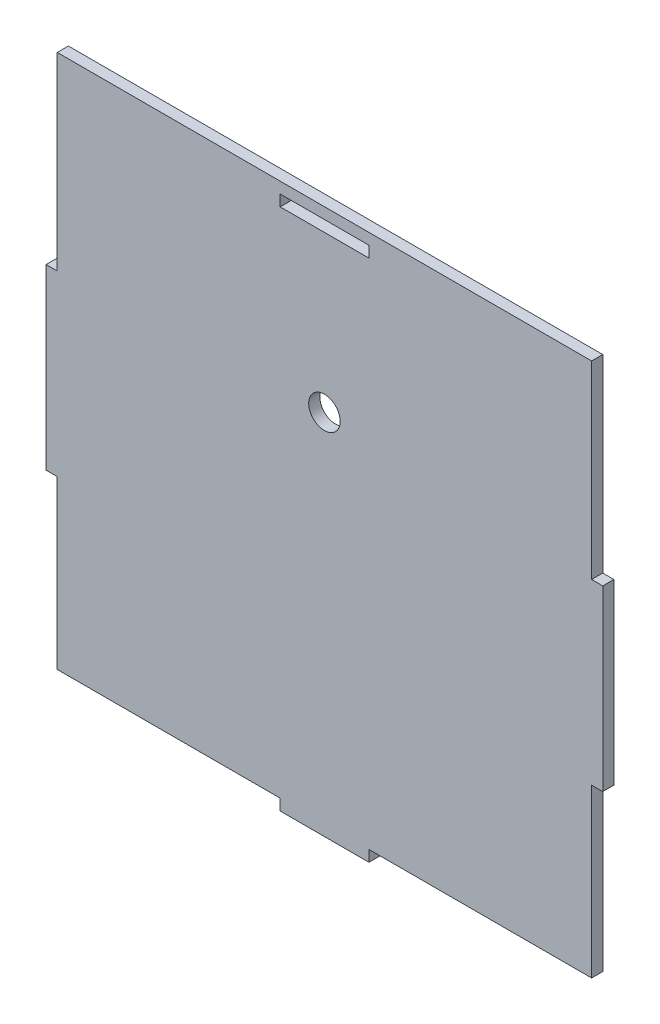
ISO-10303-21;
HEADER;
FILE_DESCRIPTION(('STEP AP214'),'2;1');
FILE_NAME('part.step','',(''),(''),'','','');
FILE_SCHEMA(('AUTOMOTIVE_DESIGN { 1 0 10303 214 1 1 1 1 }'));
ENDSEC;
DATA;
#1=APPLICATION_CONTEXT('core data for automotive mechanical design processes');
#2=APPLICATION_PROTOCOL_DEFINITION('international standard','automotive_design',2000,#1);
#3=PRODUCT_CONTEXT('',#1,'mechanical');
#4=PRODUCT('Part','Part','',(#3));
#5=PRODUCT_RELATED_PRODUCT_CATEGORY('part','',(#4));
#6=PRODUCT_DEFINITION_FORMATION('','',#4);
#7=PRODUCT_DEFINITION_CONTEXT('part definition',#1,'design');
#8=PRODUCT_DEFINITION('design','',#6,#7);
#9=PRODUCT_DEFINITION_SHAPE('','',#8);
#10=(LENGTH_UNIT() NAMED_UNIT(*) SI_UNIT(.MILLI.,.METRE.));
#11=(NAMED_UNIT(*) PLANE_ANGLE_UNIT() SI_UNIT($,.RADIAN.));
#12=(NAMED_UNIT(*) SI_UNIT($,.STERADIAN.) SOLID_ANGLE_UNIT());
#13=UNCERTAINTY_MEASURE_WITH_UNIT(LENGTH_MEASURE(1.E-05),#10,'distance_accuracy_value','');
#14=(GEOMETRIC_REPRESENTATION_CONTEXT(3) GLOBAL_UNCERTAINTY_ASSIGNED_CONTEXT((#13)) GLOBAL_UNIT_ASSIGNED_CONTEXT((#10,
#11,#12)) REPRESENTATION_CONTEXT('',''));
#15=CARTESIAN_POINT('',(0.,0.,0.));
#16=DIRECTION('',(0.,0.,1.));
#17=DIRECTION('',(1.,0.,0.));
#18=AXIS2_PLACEMENT_3D('',#15,#16,#17);
#19=CARTESIAN_POINT('',(-30.4580633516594,-24.0194605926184,3.175));
#20=DIRECTION('',(0.,0.,-1.));
#21=DIRECTION('',(-1.,0.,0.));
#22=AXIS2_PLACEMENT_3D('',#19,#20,#21);
#23=PLANE('',#22);
#24=DIRECTION('',(0.,-1.,0.));
#25=VECTOR('',#24,1.);
#26=CARTESIAN_POINT('',(33.1213613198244,26.7805394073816,3.175));
#27=LINE('',#26,#25);
#28=CARTESIAN_POINT('',(33.1213613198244,26.7805394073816,3.175));
#29=VERTEX_POINT('',#28);
#30=CARTESIAN_POINT('',(33.1213613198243,23.6055394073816,3.175));
#31=VERTEX_POINT('',#30);
#32=EDGE_CURVE('E169',#29,#31,#27,.T.);
#33=ORIENTED_EDGE('',*,*,#32,.F.);
#34=DIRECTION('',(-1.,0.,0.));
#35=VECTOR('',#34,1.);
#36=CARTESIAN_POINT('',(33.1213613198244,26.7805394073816,3.175));
#37=LINE('',#36,#35);
#38=CARTESIAN_POINT('',(58.5213613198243,26.7805394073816,3.175));
#39=VERTEX_POINT('',#38);
#40=EDGE_CURVE('E192',#39,#29,#37,.T.);
#41=ORIENTED_EDGE('',*,*,#40,.F.);
#42=DIRECTION('',(0.,1.,0.));
#43=VECTOR('',#42,1.);
#44=CARTESIAN_POINT('',(58.5213613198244,26.7805394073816,3.175));
#45=LINE('',#44,#43);
#46=CARTESIAN_POINT('',(58.5213613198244,23.6055394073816,3.175));
#47=VERTEX_POINT('',#46);
#48=EDGE_CURVE('E190',#47,#39,#45,.T.);
#49=ORIENTED_EDGE('',*,*,#48,.F.);
#50=DIRECTION('',(1.,0.,0.));
#51=VECTOR('',#50,1.);
#52=CARTESIAN_POINT('',(33.1213613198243,23.6055394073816,3.175));
#53=LINE('',#52,#51);
#54=EDGE_CURVE('E177',#31,#47,#53,.T.);
#55=ORIENTED_EDGE('',*,*,#54,.F.);
#56=EDGE_LOOP('',(#33,#41,#49,#55));
#57=FACE_BOUND('',#56,.T.);
#58=DIRECTION('',(0.,-1.,0.));
#59=VECTOR('',#58,1.);
#60=CARTESIAN_POINT('',(-30.4580633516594,29.9555394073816,3.175));
#61=LINE('',#60,#59);
#62=CARTESIAN_POINT('',(-30.4580633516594,29.9555394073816,3.175));
#63=VERTEX_POINT('',#62);
#64=CARTESIAN_POINT('',(-30.4580633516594,-24.0194605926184,3.175));
#65=VERTEX_POINT('',#64);
#66=EDGE_CURVE('E208',#63,#65,#61,.T.);
#67=ORIENTED_EDGE('',*,*,#66,.T.);
#68=DIRECTION('',(-1.,0.,0.));
#69=VECTOR('',#68,1.);
#70=CARTESIAN_POINT('',(-30.4580633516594,-24.0194605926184,3.175));
#71=LINE('',#70,#69);
#72=CARTESIAN_POINT('',(-33.6330633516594,-24.0194605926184,3.175));
#73=VERTEX_POINT('',#72);
#74=EDGE_CURVE('E211',#65,#73,#71,.T.);
#75=ORIENTED_EDGE('',*,*,#74,.T.);
#76=DIRECTION('',(0.,-1.,0.));
#77=VECTOR('',#76,1.);
#78=CARTESIAN_POINT('',(-33.6330633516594,-24.0194605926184,3.175));
#79=LINE('',#78,#77);
#80=CARTESIAN_POINT('',(-33.6330633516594,-74.8194605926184,3.175));
#81=VERTEX_POINT('',#80);
#82=EDGE_CURVE('E214',#73,#81,#79,.T.);
#83=ORIENTED_EDGE('',*,*,#82,.T.);
#84=DIRECTION('',(1.,0.,0.));
#85=VECTOR('',#84,1.);
#86=CARTESIAN_POINT('',(-30.4580633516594,-74.8194605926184,3.175));
#87=LINE('',#86,#85);
#88=CARTESIAN_POINT('',(-30.4580633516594,-74.8194605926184,3.175));
#89=VERTEX_POINT('',#88);
#90=EDGE_CURVE('E216',#81,#89,#87,.T.);
#91=ORIENTED_EDGE('',*,*,#90,.T.);
#92=DIRECTION('',(0.,-1.,0.));
#93=VECTOR('',#92,1.);
#94=CARTESIAN_POINT('',(-30.4580633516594,-74.8194605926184,3.175));
#95=LINE('',#94,#93);
#96=CARTESIAN_POINT('',(-30.4580633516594,-122.444460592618,3.175));
#97=VERTEX_POINT('',#96);
#98=EDGE_CURVE('E218',#89,#97,#95,.T.);
#99=ORIENTED_EDGE('',*,*,#98,.T.);
#100=DIRECTION('',(1.,0.,0.));
#101=VECTOR('',#100,1.);
#102=CARTESIAN_POINT('',(-30.4580633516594,-122.444460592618,3.175));
#103=LINE('',#102,#101);
#104=CARTESIAN_POINT('',(33.0419366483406,-122.444460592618,3.175));
#105=VERTEX_POINT('',#104);
#106=EDGE_CURVE('E220',#97,#105,#103,.T.);
#107=ORIENTED_EDGE('',*,*,#106,.T.);
#108=DIRECTION('',(0.,-1.,0.));
#109=VECTOR('',#108,1.);
#110=CARTESIAN_POINT('',(33.0419366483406,-122.444460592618,3.175));
#111=LINE('',#110,#109);
#112=CARTESIAN_POINT('',(33.0419366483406,-125.619460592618,3.175));
#113=VERTEX_POINT('',#112);
#114=EDGE_CURVE('E222',#105,#113,#111,.T.);
#115=ORIENTED_EDGE('',*,*,#114,.T.);
#116=DIRECTION('',(1.,0.,0.));
#117=VECTOR('',#116,1.);
#118=CARTESIAN_POINT('',(33.0419366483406,-125.619460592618,3.175));
#119=LINE('',#118,#117);
#120=CARTESIAN_POINT('',(58.4419366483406,-125.619460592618,3.175));
#121=VERTEX_POINT('',#120);
#122=EDGE_CURVE('E224',#113,#121,#119,.T.);
#123=ORIENTED_EDGE('',*,*,#122,.T.);
#124=DIRECTION('',(0.,1.,0.));
#125=VECTOR('',#124,1.);
#126=CARTESIAN_POINT('',(58.4419366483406,-122.444460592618,3.175));
#127=LINE('',#126,#125);
#128=CARTESIAN_POINT('',(58.4419366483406,-122.444460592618,3.175));
#129=VERTEX_POINT('',#128);
#130=EDGE_CURVE('E226',#121,#129,#127,.T.);
#131=ORIENTED_EDGE('',*,*,#130,.T.);
#132=DIRECTION('',(1.,0.,0.));
#133=VECTOR('',#132,1.);
#134=CARTESIAN_POINT('',(58.4419366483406,-122.444460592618,3.175));
#135=LINE('',#134,#133);
#136=CARTESIAN_POINT('',(121.941936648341,-122.444460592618,3.175));
#137=VERTEX_POINT('',#136);
#138=EDGE_CURVE('E228',#129,#137,#135,.T.);
#139=ORIENTED_EDGE('',*,*,#138,.T.);
#140=DIRECTION('',(0.,1.,0.));
#141=VECTOR('',#140,1.);
#142=CARTESIAN_POINT('',(121.941936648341,-74.8194605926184,3.175));
#143=LINE('',#142,#141);
#144=CARTESIAN_POINT('',(121.941936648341,-74.8194605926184,3.175));
#145=VERTEX_POINT('',#144);
#146=EDGE_CURVE('E230',#137,#145,#143,.T.);
#147=ORIENTED_EDGE('',*,*,#146,.T.);
#148=DIRECTION('',(1.,0.,0.));
#149=VECTOR('',#148,1.);
#150=CARTESIAN_POINT('',(121.941936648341,-74.8194605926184,3.175));
#151=LINE('',#150,#149);
#152=CARTESIAN_POINT('',(125.116936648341,-74.8194605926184,3.175));
#153=VERTEX_POINT('',#152);
#154=EDGE_CURVE('E232',#145,#153,#151,.T.);
#155=ORIENTED_EDGE('',*,*,#154,.T.);
#156=DIRECTION('',(0.,1.,0.));
#157=VECTOR('',#156,1.);
#158=CARTESIAN_POINT('',(125.116936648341,-24.0194605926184,3.175));
#159=LINE('',#158,#157);
#160=CARTESIAN_POINT('',(125.116936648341,-24.0194605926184,3.175));
#161=VERTEX_POINT('',#160);
#162=EDGE_CURVE('E234',#153,#161,#159,.T.);
#163=ORIENTED_EDGE('',*,*,#162,.T.);
#164=DIRECTION('',(-1.,0.,0.));
#165=VECTOR('',#164,1.);
#166=CARTESIAN_POINT('',(121.941936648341,-24.0194605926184,3.175));
#167=LINE('',#166,#165);
#168=CARTESIAN_POINT('',(121.941936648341,-24.0194605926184,3.175));
#169=VERTEX_POINT('',#168);
#170=EDGE_CURVE('E236',#161,#169,#167,.T.);
#171=ORIENTED_EDGE('',*,*,#170,.T.);
#172=DIRECTION('',(0.,1.,0.));
#173=VECTOR('',#172,1.);
#174=CARTESIAN_POINT('',(121.941936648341,29.9555394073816,3.175));
#175=LINE('',#174,#173);
#176=CARTESIAN_POINT('',(121.941936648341,29.9555394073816,3.175));
#177=VERTEX_POINT('',#176);
#178=EDGE_CURVE('E238',#169,#177,#175,.T.);
#179=ORIENTED_EDGE('',*,*,#178,.T.);
#180=DIRECTION('',(-1.,0.,0.));
#181=VECTOR('',#180,1.);
#182=CARTESIAN_POINT('',(-30.4580633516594,29.9555394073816,3.175));
#183=LINE('',#182,#181);
#184=EDGE_CURVE('E240',#177,#63,#183,.T.);
#185=ORIENTED_EDGE('',*,*,#184,.T.);
#186=EDGE_LOOP('',(#67,#75,#83,#91,#99,#107,#115,#123,#131,#139,#147,#155,#163,#171,#179,#185));
#187=FACE_BOUND('',#186,.T.);
#188=CARTESIAN_POINT('',(45.7419366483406,-20.8444605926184,3.175));
#189=DIRECTION('',(0.,0.,1.));
#190=DIRECTION('',(1.,0.,0.));
#191=AXIS2_PLACEMENT_3D('',#188,#189,#190);
#192=CIRCLE('',#191,4.49012806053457);
#193=CARTESIAN_POINT('',(50.2320647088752,-20.8444605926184,3.175));
#194=VERTEX_POINT('',#193);
#195=EDGE_CURVE('E198',#194,#194,#192,.T.);
#196=ORIENTED_EDGE('',*,*,#195,.F.);
#197=EDGE_LOOP('',(#196));
#198=FACE_BOUND('',#197,.T.);
#199=ADVANCED_FACE('F32',(#57,#187,#198),#23,.F.);
#200=CARTESIAN_POINT('',(-30.4580633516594,-24.0194605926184,0.));
#201=DIRECTION('',(0.,0.,-1.));
#202=DIRECTION('',(-1.,0.,0.));
#203=AXIS2_PLACEMENT_3D('',#200,#201,#202);
#204=PLANE('',#203);
#205=DIRECTION('',(-1.,0.,0.));
#206=VECTOR('',#205,1.);
#207=CARTESIAN_POINT('',(33.1213613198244,26.7805394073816,0.));
#208=LINE('',#207,#206);
#209=CARTESIAN_POINT('',(58.5213613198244,26.7805394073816,0.));
#210=VERTEX_POINT('',#209);
#211=CARTESIAN_POINT('',(33.1213613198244,26.7805394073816,0.));
#212=VERTEX_POINT('',#211);
#213=EDGE_CURVE('E178',#210,#212,#208,.T.);
#214=ORIENTED_EDGE('',*,*,#213,.T.);
#215=DIRECTION('',(0.,-1.,0.));
#216=VECTOR('',#215,1.);
#217=CARTESIAN_POINT('',(33.1213613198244,26.7805394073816,0.));
#218=LINE('',#217,#216);
#219=CARTESIAN_POINT('',(33.1213613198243,23.6055394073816,0.));
#220=VERTEX_POINT('',#219);
#221=EDGE_CURVE('E55',#212,#220,#218,.T.);
#222=ORIENTED_EDGE('',*,*,#221,.T.);
#223=DIRECTION('',(1.,0.,0.));
#224=VECTOR('',#223,1.);
#225=CARTESIAN_POINT('',(33.1213613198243,23.6055394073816,0.));
#226=LINE('',#225,#224);
#227=CARTESIAN_POINT('',(58.5213613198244,23.6055394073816,0.));
#228=VERTEX_POINT('',#227);
#229=EDGE_CURVE('E184',#220,#228,#226,.T.);
#230=ORIENTED_EDGE('',*,*,#229,.T.);
#231=DIRECTION('',(0.,1.,0.));
#232=VECTOR('',#231,1.);
#233=CARTESIAN_POINT('',(58.5213613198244,26.7805394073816,0.));
#234=LINE('',#233,#232);
#235=EDGE_CURVE('E200',#228,#210,#234,.T.);
#236=ORIENTED_EDGE('',*,*,#235,.T.);
#237=EDGE_LOOP('',(#214,#222,#230,#236));
#238=FACE_BOUND('',#237,.T.);
#239=DIRECTION('',(0.,-1.,0.));
#240=VECTOR('',#239,1.);
#241=CARTESIAN_POINT('',(-30.4580633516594,29.9555394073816,0.));
#242=LINE('',#241,#240);
#243=CARTESIAN_POINT('',(-30.4580633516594,29.9555394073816,0.));
#244=VERTEX_POINT('',#243);
#245=CARTESIAN_POINT('',(-30.4580633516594,-24.0194605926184,0.));
#246=VERTEX_POINT('',#245);
#247=EDGE_CURVE('E185',#244,#246,#242,.T.);
#248=ORIENTED_EDGE('',*,*,#247,.F.);
#249=DIRECTION('',(-1.,0.,0.));
#250=VECTOR('',#249,1.);
#251=CARTESIAN_POINT('',(-30.4580633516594,29.9555394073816,0.));
#252=LINE('',#251,#250);
#253=CARTESIAN_POINT('',(121.941936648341,29.9555394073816,0.));
#254=VERTEX_POINT('',#253);
#255=EDGE_CURVE('E212',#254,#244,#252,.T.);
#256=ORIENTED_EDGE('',*,*,#255,.F.);
#257=DIRECTION('',(0.,1.,0.));
#258=VECTOR('',#257,1.);
#259=CARTESIAN_POINT('',(121.941936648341,29.9555394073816,0.));
#260=LINE('',#259,#258);
#261=CARTESIAN_POINT('',(121.941936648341,-24.0194605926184,0.));
#262=VERTEX_POINT('',#261);
#263=EDGE_CURVE('E271',#262,#254,#260,.T.);
#264=ORIENTED_EDGE('',*,*,#263,.F.);
#265=DIRECTION('',(-1.,0.,0.));
#266=VECTOR('',#265,1.);
#267=CARTESIAN_POINT('',(121.941936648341,-24.0194605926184,0.));
#268=LINE('',#267,#266);
#269=CARTESIAN_POINT('',(125.116936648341,-24.0194605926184,0.));
#270=VERTEX_POINT('',#269);
#271=EDGE_CURVE('E269',#270,#262,#268,.T.);
#272=ORIENTED_EDGE('',*,*,#271,.F.);
#273=DIRECTION('',(0.,1.,0.));
#274=VECTOR('',#273,1.);
#275=CARTESIAN_POINT('',(125.116936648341,-24.0194605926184,0.));
#276=LINE('',#275,#274);
#277=CARTESIAN_POINT('',(125.116936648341,-74.8194605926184,0.));
#278=VERTEX_POINT('',#277);
#279=EDGE_CURVE('E267',#278,#270,#276,.T.);
#280=ORIENTED_EDGE('',*,*,#279,.F.);
#281=DIRECTION('',(1.,0.,0.));
#282=VECTOR('',#281,1.);
#283=CARTESIAN_POINT('',(121.941936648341,-74.8194605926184,0.));
#284=LINE('',#283,#282);
#285=CARTESIAN_POINT('',(121.941936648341,-74.8194605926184,0.));
#286=VERTEX_POINT('',#285);
#287=EDGE_CURVE('E265',#286,#278,#284,.T.);
#288=ORIENTED_EDGE('',*,*,#287,.F.);
#289=DIRECTION('',(0.,1.,0.));
#290=VECTOR('',#289,1.);
#291=CARTESIAN_POINT('',(121.941936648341,-74.8194605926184,0.));
#292=LINE('',#291,#290);
#293=CARTESIAN_POINT('',(121.941936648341,-122.444460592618,0.));
#294=VERTEX_POINT('',#293);
#295=EDGE_CURVE('E263',#294,#286,#292,.T.);
#296=ORIENTED_EDGE('',*,*,#295,.F.);
#297=DIRECTION('',(1.,0.,0.));
#298=VECTOR('',#297,1.);
#299=CARTESIAN_POINT('',(58.4419366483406,-122.444460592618,0.));
#300=LINE('',#299,#298);
#301=CARTESIAN_POINT('',(58.4419366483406,-122.444460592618,0.));
#302=VERTEX_POINT('',#301);
#303=EDGE_CURVE('E261',#302,#294,#300,.T.);
#304=ORIENTED_EDGE('',*,*,#303,.F.);
#305=DIRECTION('',(0.,1.,0.));
#306=VECTOR('',#305,1.);
#307=CARTESIAN_POINT('',(58.4419366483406,-122.444460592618,0.));
#308=LINE('',#307,#306);
#309=CARTESIAN_POINT('',(58.4419366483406,-125.619460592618,0.));
#310=VERTEX_POINT('',#309);
#311=EDGE_CURVE('E259',#310,#302,#308,.T.);
#312=ORIENTED_EDGE('',*,*,#311,.F.);
#313=DIRECTION('',(1.,0.,0.));
#314=VECTOR('',#313,1.);
#315=CARTESIAN_POINT('',(33.0419366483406,-125.619460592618,0.));
#316=LINE('',#315,#314);
#317=CARTESIAN_POINT('',(33.0419366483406,-125.619460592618,0.));
#318=VERTEX_POINT('',#317);
#319=EDGE_CURVE('E257',#318,#310,#316,.T.);
#320=ORIENTED_EDGE('',*,*,#319,.F.);
#321=DIRECTION('',(0.,-1.,0.));
#322=VECTOR('',#321,1.);
#323=CARTESIAN_POINT('',(33.0419366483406,-122.444460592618,0.));
#324=LINE('',#323,#322);
#325=CARTESIAN_POINT('',(33.0419366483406,-122.444460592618,0.));
#326=VERTEX_POINT('',#325);
#327=EDGE_CURVE('E255',#326,#318,#324,.T.);
#328=ORIENTED_EDGE('',*,*,#327,.F.);
#329=DIRECTION('',(1.,0.,0.));
#330=VECTOR('',#329,1.);
#331=CARTESIAN_POINT('',(-30.4580633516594,-122.444460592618,0.));
#332=LINE('',#331,#330);
#333=CARTESIAN_POINT('',(-30.4580633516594,-122.444460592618,0.));
#334=VERTEX_POINT('',#333);
#335=EDGE_CURVE('E253',#334,#326,#332,.T.);
#336=ORIENTED_EDGE('',*,*,#335,.F.);
#337=DIRECTION('',(0.,-1.,0.));
#338=VECTOR('',#337,1.);
#339=CARTESIAN_POINT('',(-30.4580633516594,-74.8194605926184,0.));
#340=LINE('',#339,#338);
#341=CARTESIAN_POINT('',(-30.4580633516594,-74.8194605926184,0.));
#342=VERTEX_POINT('',#341);
#343=EDGE_CURVE('E251',#342,#334,#340,.T.);
#344=ORIENTED_EDGE('',*,*,#343,.F.);
#345=DIRECTION('',(1.,0.,0.));
#346=VECTOR('',#345,1.);
#347=CARTESIAN_POINT('',(-30.4580633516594,-74.8194605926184,0.));
#348=LINE('',#347,#346);
#349=CARTESIAN_POINT('',(-33.6330633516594,-74.8194605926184,0.));
#350=VERTEX_POINT('',#349);
#351=EDGE_CURVE('E249',#350,#342,#348,.T.);
#352=ORIENTED_EDGE('',*,*,#351,.F.);
#353=DIRECTION('',(0.,-1.,0.));
#354=VECTOR('',#353,1.);
#355=CARTESIAN_POINT('',(-33.6330633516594,-24.0194605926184,0.));
#356=LINE('',#355,#354);
#357=CARTESIAN_POINT('',(-33.6330633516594,-24.0194605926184,0.));
#358=VERTEX_POINT('',#357);
#359=EDGE_CURVE('E247',#358,#350,#356,.T.);
#360=ORIENTED_EDGE('',*,*,#359,.F.);
#361=DIRECTION('',(-1.,0.,0.));
#362=VECTOR('',#361,1.);
#363=CARTESIAN_POINT('',(-30.4580633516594,-24.0194605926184,0.));
#364=LINE('',#363,#362);
#365=EDGE_CURVE('E245',#246,#358,#364,.T.);
#366=ORIENTED_EDGE('',*,*,#365,.F.);
#367=EDGE_LOOP('',(#248,#256,#264,#272,#280,#288,#296,#304,#312,#320,#328,#336,#344,#352,#360,#366));
#368=FACE_BOUND('',#367,.T.);
#369=CARTESIAN_POINT('',(45.7419366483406,-20.8444605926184,0.));
#370=DIRECTION('',(0.,0.,1.));
#371=DIRECTION('',(1.,0.,0.));
#372=AXIS2_PLACEMENT_3D('',#369,#370,#371);
#373=CIRCLE('',#372,4.49012806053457);
#374=CARTESIAN_POINT('',(50.2320647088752,-20.8444605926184,0.));
#375=VERTEX_POINT('',#374);
#376=EDGE_CURVE('E589',#375,#375,#373,.T.);
#377=ORIENTED_EDGE('',*,*,#376,.T.);
#378=EDGE_LOOP('',(#377));
#379=FACE_BOUND('',#378,.T.);
#380=ADVANCED_FACE('F325',(#238,#368,#379),#204,.T.);
#381=CARTESIAN_POINT('',(-30.4580633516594,29.9555394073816,3.175));
#382=DIRECTION('',(1.,0.,0.));
#383=DIRECTION('',(0.,1.,0.));
#384=AXIS2_PLACEMENT_3D('',#381,#382,#383);
#385=PLANE('',#384);
#386=ORIENTED_EDGE('',*,*,#247,.T.);
#387=DIRECTION('',(0.,0.,-1.));
#388=VECTOR('',#387,1.);
#389=CARTESIAN_POINT('',(-30.4580633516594,-24.0194605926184,3.175));
#390=LINE('',#389,#388);
#391=EDGE_CURVE('E11',#65,#246,#390,.T.);
#392=ORIENTED_EDGE('',*,*,#391,.F.);
#393=ORIENTED_EDGE('',*,*,#66,.F.);
#394=DIRECTION('',(0.,0.,-1.));
#395=VECTOR('',#394,1.);
#396=CARTESIAN_POINT('',(-30.4580633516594,29.9555394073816,3.175));
#397=LINE('',#396,#395);
#398=EDGE_CURVE('E242',#63,#244,#397,.T.);
#399=ORIENTED_EDGE('',*,*,#398,.T.);
#400=EDGE_LOOP('',(#386,#392,#393,#399));
#401=FACE_BOUND('',#400,.T.);
#402=ADVANCED_FACE('F34',(#401),#385,.F.);
#403=CARTESIAN_POINT('',(-30.4580633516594,-24.0194605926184,3.175));
#404=DIRECTION('',(0.,-1.,0.));
#405=DIRECTION('',(0.,0.,-1.));
#406=AXIS2_PLACEMENT_3D('',#403,#404,#405);
#407=PLANE('',#406);
#408=ORIENTED_EDGE('',*,*,#365,.T.);
#409=DIRECTION('',(0.,0.,-1.));
#410=VECTOR('',#409,1.);
#411=CARTESIAN_POINT('',(-33.6330633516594,-24.0194605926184,3.175));
#412=LINE('',#411,#410);
#413=EDGE_CURVE('E40',#73,#358,#412,.T.);
#414=ORIENTED_EDGE('',*,*,#413,.F.);
#415=ORIENTED_EDGE('',*,*,#74,.F.);
#416=ORIENTED_EDGE('',*,*,#391,.T.);
#417=EDGE_LOOP('',(#408,#414,#415,#416));
#418=FACE_BOUND('',#417,.T.);
#419=ADVANCED_FACE('F342',(#418),#407,.F.);
#420=CARTESIAN_POINT('',(-33.6330633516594,-24.0194605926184,3.175));
#421=DIRECTION('',(1.,0.,0.));
#422=DIRECTION('',(0.,1.,0.));
#423=AXIS2_PLACEMENT_3D('',#420,#421,#422);
#424=PLANE('',#423);
#425=ORIENTED_EDGE('',*,*,#359,.T.);
#426=DIRECTION('',(0.,0.,-1.));
#427=VECTOR('',#426,1.);
#428=CARTESIAN_POINT('',(-33.6330633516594,-74.8194605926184,3.175));
#429=LINE('',#428,#427);
#430=EDGE_CURVE('E312',#81,#350,#429,.T.);
#431=ORIENTED_EDGE('',*,*,#430,.F.);
#432=ORIENTED_EDGE('',*,*,#82,.F.);
#433=ORIENTED_EDGE('',*,*,#413,.T.);
#434=EDGE_LOOP('',(#425,#431,#432,#433));
#435=FACE_BOUND('',#434,.T.);
#436=ADVANCED_FACE('F319',(#435),#424,.F.);
#437=CARTESIAN_POINT('',(-30.4580633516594,-74.8194605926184,3.175));
#438=DIRECTION('',(0.,1.,0.));
#439=DIRECTION('',(0.,0.,1.));
#440=AXIS2_PLACEMENT_3D('',#437,#438,#439);
#441=PLANE('',#440);
#442=ORIENTED_EDGE('',*,*,#351,.T.);
#443=DIRECTION('',(0.,0.,-1.));
#444=VECTOR('',#443,1.);
#445=CARTESIAN_POINT('',(-30.4580633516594,-74.8194605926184,3.175));
#446=LINE('',#445,#444);
#447=EDGE_CURVE('E309',#89,#342,#446,.T.);
#448=ORIENTED_EDGE('',*,*,#447,.F.);
#449=ORIENTED_EDGE('',*,*,#90,.F.);
#450=ORIENTED_EDGE('',*,*,#430,.T.);
#451=EDGE_LOOP('',(#442,#448,#449,#450));
#452=FACE_BOUND('',#451,.T.);
#453=ADVANCED_FACE('F331',(#452),#441,.F.);
#454=CARTESIAN_POINT('',(-30.4580633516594,-74.8194605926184,3.175));
#455=DIRECTION('',(1.,0.,0.));
#456=DIRECTION('',(0.,1.,0.));
#457=AXIS2_PLACEMENT_3D('',#454,#455,#456);
#458=PLANE('',#457);
#459=ORIENTED_EDGE('',*,*,#343,.T.);
#460=DIRECTION('',(0.,0.,-1.));
#461=VECTOR('',#460,1.);
#462=CARTESIAN_POINT('',(-30.4580633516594,-122.444460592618,3.175));
#463=LINE('',#462,#461);
#464=EDGE_CURVE('E306',#97,#334,#463,.T.);
#465=ORIENTED_EDGE('',*,*,#464,.F.);
#466=ORIENTED_EDGE('',*,*,#98,.F.);
#467=ORIENTED_EDGE('',*,*,#447,.T.);
#468=EDGE_LOOP('',(#459,#465,#466,#467));
#469=FACE_BOUND('',#468,.T.);
#470=ADVANCED_FACE('F335',(#469),#458,.F.);
#471=CARTESIAN_POINT('',(-30.4580633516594,-122.444460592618,3.175));
#472=DIRECTION('',(0.,1.,0.));
#473=DIRECTION('',(0.,0.,1.));
#474=AXIS2_PLACEMENT_3D('',#471,#472,#473);
#475=PLANE('',#474);
#476=ORIENTED_EDGE('',*,*,#335,.T.);
#477=DIRECTION('',(0.,0.,-1.));
#478=VECTOR('',#477,1.);
#479=CARTESIAN_POINT('',(33.0419366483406,-122.444460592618,3.175));
#480=LINE('',#479,#478);
#481=EDGE_CURVE('E303',#105,#326,#480,.T.);
#482=ORIENTED_EDGE('',*,*,#481,.F.);
#483=ORIENTED_EDGE('',*,*,#106,.F.);
#484=ORIENTED_EDGE('',*,*,#464,.T.);
#485=EDGE_LOOP('',(#476,#482,#483,#484));
#486=FACE_BOUND('',#485,.T.);
#487=ADVANCED_FACE('F395',(#486),#475,.F.);
#488=CARTESIAN_POINT('',(33.0419366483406,-122.444460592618,3.175));
#489=DIRECTION('',(1.,0.,0.));
#490=DIRECTION('',(0.,0.,-1.));
#491=AXIS2_PLACEMENT_3D('',#488,#489,#490);
#492=PLANE('',#491);
#493=ORIENTED_EDGE('',*,*,#327,.T.);
#494=DIRECTION('',(0.,0.,-1.));
#495=VECTOR('',#494,1.);
#496=CARTESIAN_POINT('',(33.0419366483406,-125.619460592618,3.175));
#497=LINE('',#496,#495);
#498=EDGE_CURVE('E300',#113,#318,#497,.T.);
#499=ORIENTED_EDGE('',*,*,#498,.F.);
#500=ORIENTED_EDGE('',*,*,#114,.F.);
#501=ORIENTED_EDGE('',*,*,#481,.T.);
#502=EDGE_LOOP('',(#493,#499,#500,#501));
#503=FACE_BOUND('',#502,.T.);
#504=ADVANCED_FACE('F392',(#503),#492,.F.);
#505=CARTESIAN_POINT('',(33.0419366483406,-125.619460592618,3.175));
#506=DIRECTION('',(0.,1.,0.));
#507=DIRECTION('',(0.,0.,1.));
#508=AXIS2_PLACEMENT_3D('',#505,#506,#507);
#509=PLANE('',#508);
#510=ORIENTED_EDGE('',*,*,#319,.T.);
#511=DIRECTION('',(0.,0.,-1.));
#512=VECTOR('',#511,1.);
#513=CARTESIAN_POINT('',(58.4419366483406,-125.619460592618,3.175));
#514=LINE('',#513,#512);
#515=EDGE_CURVE('E297',#121,#310,#514,.T.);
#516=ORIENTED_EDGE('',*,*,#515,.F.);
#517=ORIENTED_EDGE('',*,*,#122,.F.);
#518=ORIENTED_EDGE('',*,*,#498,.T.);
#519=EDGE_LOOP('',(#510,#516,#517,#518));
#520=FACE_BOUND('',#519,.T.);
#521=ADVANCED_FACE('F388',(#520),#509,.F.);
#522=CARTESIAN_POINT('',(58.4419366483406,-122.444460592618,3.175));
#523=DIRECTION('',(-1.,0.,0.));
#524=DIRECTION('',(0.,-1.,0.));
#525=AXIS2_PLACEMENT_3D('',#522,#523,#524);
#526=PLANE('',#525);
#527=ORIENTED_EDGE('',*,*,#311,.T.);
#528=DIRECTION('',(0.,0.,-1.));
#529=VECTOR('',#528,1.);
#530=CARTESIAN_POINT('',(58.4419366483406,-122.444460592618,3.175));
#531=LINE('',#530,#529);
#532=EDGE_CURVE('E294',#129,#302,#531,.T.);
#533=ORIENTED_EDGE('',*,*,#532,.F.);
#534=ORIENTED_EDGE('',*,*,#130,.F.);
#535=ORIENTED_EDGE('',*,*,#515,.T.);
#536=EDGE_LOOP('',(#527,#533,#534,#535));
#537=FACE_BOUND('',#536,.T.);
#538=ADVANCED_FACE('F384',(#537),#526,.F.);
#539=CARTESIAN_POINT('',(58.4419366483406,-122.444460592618,3.175));
#540=DIRECTION('',(0.,1.,0.));
#541=DIRECTION('',(-1.,0.,0.));
#542=AXIS2_PLACEMENT_3D('',#539,#540,#541);
#543=PLANE('',#542);
#544=ORIENTED_EDGE('',*,*,#303,.T.);
#545=DIRECTION('',(0.,0.,-1.));
#546=VECTOR('',#545,1.);
#547=CARTESIAN_POINT('',(121.941936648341,-122.444460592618,3.175));
#548=LINE('',#547,#546);
#549=EDGE_CURVE('E291',#137,#294,#548,.T.);
#550=ORIENTED_EDGE('',*,*,#549,.F.);
#551=ORIENTED_EDGE('',*,*,#138,.F.);
#552=ORIENTED_EDGE('',*,*,#532,.T.);
#553=EDGE_LOOP('',(#544,#550,#551,#552));
#554=FACE_BOUND('',#553,.T.);
#555=ADVANCED_FACE('F379',(#554),#543,.F.);
#556=CARTESIAN_POINT('',(121.941936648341,-74.8194605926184,3.175));
#557=DIRECTION('',(-1.,0.,0.));
#558=DIRECTION('',(0.,-1.,0.));
#559=AXIS2_PLACEMENT_3D('',#556,#557,#558);
#560=PLANE('',#559);
#561=ORIENTED_EDGE('',*,*,#295,.T.);
#562=DIRECTION('',(0.,0.,-1.));
#563=VECTOR('',#562,1.);
#564=CARTESIAN_POINT('',(121.941936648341,-74.8194605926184,3.175));
#565=LINE('',#564,#563);
#566=EDGE_CURVE('E288',#145,#286,#565,.T.);
#567=ORIENTED_EDGE('',*,*,#566,.F.);
#568=ORIENTED_EDGE('',*,*,#146,.F.);
#569=ORIENTED_EDGE('',*,*,#549,.T.);
#570=EDGE_LOOP('',(#561,#567,#568,#569));
#571=FACE_BOUND('',#570,.T.);
#572=ADVANCED_FACE('F373',(#571),#560,.F.);
#573=CARTESIAN_POINT('',(121.941936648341,-74.8194605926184,3.175));
#574=DIRECTION('',(0.,1.,0.));
#575=DIRECTION('',(0.,0.,1.));
#576=AXIS2_PLACEMENT_3D('',#573,#574,#575);
#577=PLANE('',#576);
#578=ORIENTED_EDGE('',*,*,#287,.T.);
#579=DIRECTION('',(0.,0.,-1.));
#580=VECTOR('',#579,1.);
#581=CARTESIAN_POINT('',(125.116936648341,-74.8194605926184,3.175));
#582=LINE('',#581,#580);
#583=EDGE_CURVE('E285',#153,#278,#582,.T.);
#584=ORIENTED_EDGE('',*,*,#583,.F.);
#585=ORIENTED_EDGE('',*,*,#154,.F.);
#586=ORIENTED_EDGE('',*,*,#566,.T.);
#587=EDGE_LOOP('',(#578,#584,#585,#586));
#588=FACE_BOUND('',#587,.T.);
#589=ADVANCED_FACE('F369',(#588),#577,.F.);
#590=CARTESIAN_POINT('',(125.116936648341,-24.0194605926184,3.175));
#591=DIRECTION('',(-1.,0.,0.));
#592=DIRECTION('',(0.,-1.,0.));
#593=AXIS2_PLACEMENT_3D('',#590,#591,#592);
#594=PLANE('',#593);
#595=ORIENTED_EDGE('',*,*,#279,.T.);
#596=DIRECTION('',(0.,0.,-1.));
#597=VECTOR('',#596,1.);
#598=CARTESIAN_POINT('',(125.116936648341,-24.0194605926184,3.175));
#599=LINE('',#598,#597);
#600=EDGE_CURVE('E282',#161,#270,#599,.T.);
#601=ORIENTED_EDGE('',*,*,#600,.F.);
#602=ORIENTED_EDGE('',*,*,#162,.F.);
#603=ORIENTED_EDGE('',*,*,#583,.T.);
#604=EDGE_LOOP('',(#595,#601,#602,#603));
#605=FACE_BOUND('',#604,.T.);
#606=ADVANCED_FACE('F364',(#605),#594,.F.);
#607=CARTESIAN_POINT('',(121.941936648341,-24.0194605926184,3.175));
#608=DIRECTION('',(0.,-1.,0.));
#609=DIRECTION('',(0.,0.,-1.));
#610=AXIS2_PLACEMENT_3D('',#607,#608,#609);
#611=PLANE('',#610);
#612=ORIENTED_EDGE('',*,*,#271,.T.);
#613=DIRECTION('',(0.,0.,-1.));
#614=VECTOR('',#613,1.);
#615=CARTESIAN_POINT('',(121.941936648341,-24.0194605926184,3.175));
#616=LINE('',#615,#614);
#617=EDGE_CURVE('E279',#169,#262,#616,.T.);
#618=ORIENTED_EDGE('',*,*,#617,.F.);
#619=ORIENTED_EDGE('',*,*,#170,.F.);
#620=ORIENTED_EDGE('',*,*,#600,.T.);
#621=EDGE_LOOP('',(#612,#618,#619,#620));
#622=FACE_BOUND('',#621,.T.);
#623=ADVANCED_FACE('F358',(#622),#611,.F.);
#624=CARTESIAN_POINT('',(121.941936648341,29.9555394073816,3.175));
#625=DIRECTION('',(-1.,0.,0.));
#626=DIRECTION('',(0.,0.,1.));
#627=AXIS2_PLACEMENT_3D('',#624,#625,#626);
#628=PLANE('',#627);
#629=ORIENTED_EDGE('',*,*,#263,.T.);
#630=DIRECTION('',(0.,0.,-1.));
#631=VECTOR('',#630,1.);
#632=CARTESIAN_POINT('',(121.941936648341,29.9555394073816,3.175));
#633=LINE('',#632,#631);
#634=EDGE_CURVE('E276',#177,#254,#633,.T.);
#635=ORIENTED_EDGE('',*,*,#634,.F.);
#636=ORIENTED_EDGE('',*,*,#178,.F.);
#637=ORIENTED_EDGE('',*,*,#617,.T.);
#638=EDGE_LOOP('',(#629,#635,#636,#637));
#639=FACE_BOUND('',#638,.T.);
#640=ADVANCED_FACE('F354',(#639),#628,.F.);
#641=CARTESIAN_POINT('',(-30.4580633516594,29.9555394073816,3.175));
#642=DIRECTION('',(0.,-1.,0.));
#643=DIRECTION('',(0.,0.,-1.));
#644=AXIS2_PLACEMENT_3D('',#641,#642,#643);
#645=PLANE('',#644);
#646=ORIENTED_EDGE('',*,*,#255,.T.);
#647=ORIENTED_EDGE('',*,*,#398,.F.);
#648=ORIENTED_EDGE('',*,*,#184,.F.);
#649=ORIENTED_EDGE('',*,*,#634,.T.);
#650=EDGE_LOOP('',(#646,#647,#648,#649));
#651=FACE_BOUND('',#650,.T.);
#652=ADVANCED_FACE('F349',(#651),#645,.F.);
#653=CARTESIAN_POINT('',(33.1213613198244,26.7805394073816,3.175));
#654=DIRECTION('',(1.,0.,0.));
#655=DIRECTION('',(0.,1.,0.));
#656=AXIS2_PLACEMENT_3D('',#653,#654,#655);
#657=PLANE('',#656);
#658=ORIENTED_EDGE('',*,*,#221,.F.);
#659=DIRECTION('',(0.,0.,-1.));
#660=VECTOR('',#659,1.);
#661=CARTESIAN_POINT('',(33.1213613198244,26.7805394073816,3.175));
#662=LINE('',#661,#660);
#663=EDGE_CURVE('E173',#29,#212,#662,.T.);
#664=ORIENTED_EDGE('',*,*,#663,.F.);
#665=ORIENTED_EDGE('',*,*,#32,.T.);
#666=DIRECTION('',(0.,0.,-1.));
#667=VECTOR('',#666,1.);
#668=CARTESIAN_POINT('',(33.1213613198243,23.6055394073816,3.175));
#669=LINE('',#668,#667);
#670=EDGE_CURVE('E172',#31,#220,#669,.T.);
#671=ORIENTED_EDGE('',*,*,#670,.T.);
#672=EDGE_LOOP('',(#658,#664,#665,#671));
#673=FACE_BOUND('',#672,.T.);
#674=ADVANCED_FACE('F171',(#673),#657,.T.);
#675=CARTESIAN_POINT('',(33.1213613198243,23.6055394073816,3.175));
#676=DIRECTION('',(0.,1.,0.));
#677=DIRECTION('',(0.,0.,1.));
#678=AXIS2_PLACEMENT_3D('',#675,#676,#677);
#679=PLANE('',#678);
#680=ORIENTED_EDGE('',*,*,#229,.F.);
#681=ORIENTED_EDGE('',*,*,#670,.F.);
#682=ORIENTED_EDGE('',*,*,#54,.T.);
#683=DIRECTION('',(0.,0.,-1.));
#684=VECTOR('',#683,1.);
#685=CARTESIAN_POINT('',(58.5213613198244,23.6055394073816,3.175));
#686=LINE('',#685,#684);
#687=EDGE_CURVE('E186',#47,#228,#686,.T.);
#688=ORIENTED_EDGE('',*,*,#687,.T.);
#689=EDGE_LOOP('',(#680,#681,#682,#688));
#690=FACE_BOUND('',#689,.T.);
#691=ADVANCED_FACE('F181',(#690),#679,.T.);
#692=CARTESIAN_POINT('',(58.5213613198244,26.7805394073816,3.175));
#693=DIRECTION('',(-1.,0.,0.));
#694=DIRECTION('',(0.,-1.,0.));
#695=AXIS2_PLACEMENT_3D('',#692,#693,#694);
#696=PLANE('',#695);
#697=ORIENTED_EDGE('',*,*,#235,.F.);
#698=ORIENTED_EDGE('',*,*,#687,.F.);
#699=ORIENTED_EDGE('',*,*,#48,.T.);
#700=DIRECTION('',(0.,0.,-1.));
#701=VECTOR('',#700,1.);
#702=CARTESIAN_POINT('',(58.5213613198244,26.7805394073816,3.175));
#703=LINE('',#702,#701);
#704=EDGE_CURVE('E47',#39,#210,#703,.T.);
#705=ORIENTED_EDGE('',*,*,#704,.T.);
#706=EDGE_LOOP('',(#697,#698,#699,#705));
#707=FACE_BOUND('',#706,.T.);
#708=ADVANCED_FACE('F478',(#707),#696,.T.);
#709=CARTESIAN_POINT('',(33.1213613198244,26.7805394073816,3.175));
#710=DIRECTION('',(0.,-1.,0.));
#711=DIRECTION('',(0.,0.,-1.));
#712=AXIS2_PLACEMENT_3D('',#709,#710,#711);
#713=PLANE('',#712);
#714=ORIENTED_EDGE('',*,*,#213,.F.);
#715=ORIENTED_EDGE('',*,*,#704,.F.);
#716=ORIENTED_EDGE('',*,*,#40,.T.);
#717=ORIENTED_EDGE('',*,*,#663,.T.);
#718=EDGE_LOOP('',(#714,#715,#716,#717));
#719=FACE_BOUND('',#718,.T.);
#720=ADVANCED_FACE('F484',(#719),#713,.T.);
#721=CARTESIAN_POINT('',(45.7419366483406,-20.8444605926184,3.175));
#722=DIRECTION('',(0.,0.,-1.));
#723=DIRECTION('',(-1.,0.,0.));
#724=AXIS2_PLACEMENT_3D('',#721,#722,#723);
#725=CYLINDRICAL_SURFACE('',#724,4.49012806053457);
#726=ORIENTED_EDGE('',*,*,#195,.T.);
#727=EDGE_LOOP('',(#726));
#728=FACE_BOUND('',#727,.T.);
#729=ORIENTED_EDGE('',*,*,#376,.F.);
#730=EDGE_LOOP('',(#729));
#731=FACE_BOUND('',#730,.T.);
#732=ADVANCED_FACE('F492',(#728,#731),#725,.F.);
#733=CLOSED_SHELL('',(#199,#380,#402,#419,#436,#453,#470,#487,#504,#521,#538,#555,#572,#589,
#606,#623,#640,#652,#674,#691,#708,#720,#732));
#734=MANIFOLD_SOLID_BREP('B2',#733);
#735=ADVANCED_BREP_SHAPE_REPRESENTATION('',(#18,#734),#14);
#736=SHAPE_DEFINITION_REPRESENTATION(#9,#735);
ENDSEC;
END-ISO-10303-21;
